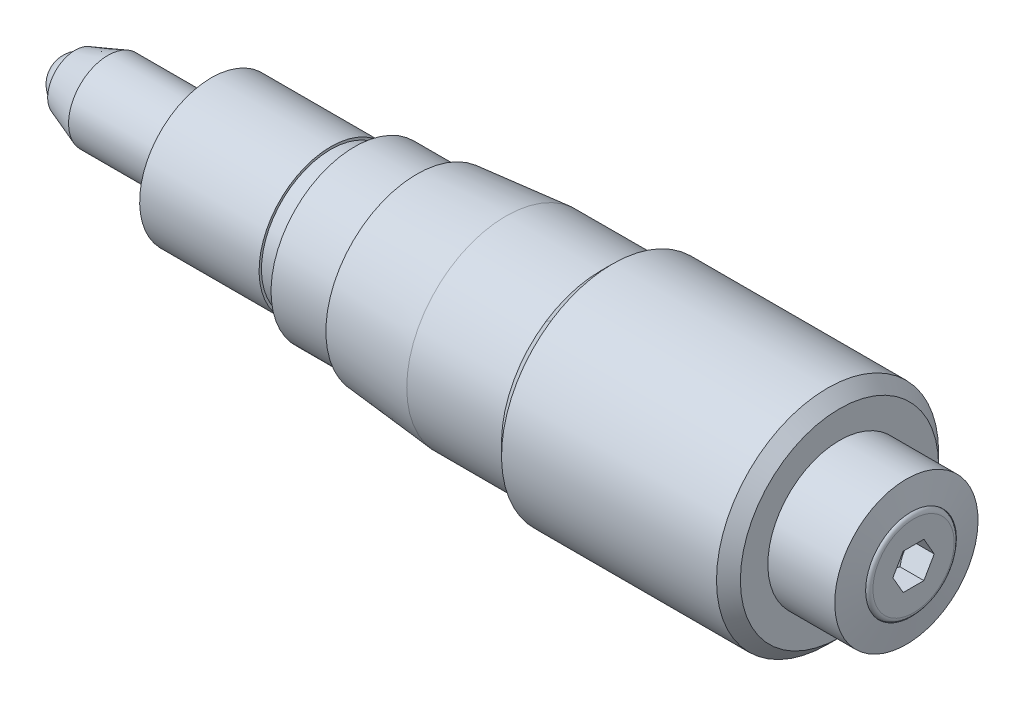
ISO-10303-21;
HEADER;
FILE_DESCRIPTION(('STEP AP214'),'2;1');
FILE_NAME('part.step','',(''),(''),'','','');
FILE_SCHEMA(('AUTOMOTIVE_DESIGN { 1 0 10303 214 1 1 1 1 }'));
ENDSEC;
DATA;
#1=APPLICATION_CONTEXT('core data for automotive mechanical design processes');
#2=APPLICATION_PROTOCOL_DEFINITION('international standard','automotive_design',2000,#1);
#3=PRODUCT_CONTEXT('',#1,'mechanical');
#4=PRODUCT('Part','Part','',(#3));
#5=PRODUCT_RELATED_PRODUCT_CATEGORY('part','',(#4));
#6=PRODUCT_DEFINITION_FORMATION('','',#4);
#7=PRODUCT_DEFINITION_CONTEXT('part definition',#1,'design');
#8=PRODUCT_DEFINITION('design','',#6,#7);
#9=PRODUCT_DEFINITION_SHAPE('','',#8);
#10=(LENGTH_UNIT() NAMED_UNIT(*) SI_UNIT(.MILLI.,.METRE.));
#11=(NAMED_UNIT(*) PLANE_ANGLE_UNIT() SI_UNIT($,.RADIAN.));
#12=(NAMED_UNIT(*) SI_UNIT($,.STERADIAN.) SOLID_ANGLE_UNIT());
#13=UNCERTAINTY_MEASURE_WITH_UNIT(LENGTH_MEASURE(1.E-05),#10,'distance_accuracy_value','');
#14=(GEOMETRIC_REPRESENTATION_CONTEXT(3) GLOBAL_UNCERTAINTY_ASSIGNED_CONTEXT((#13)) GLOBAL_UNIT_ASSIGNED_CONTEXT((#10,
#11,#12)) REPRESENTATION_CONTEXT('',''));
#15=CARTESIAN_POINT('',(0.,0.,0.));
#16=DIRECTION('',(0.,0.,1.));
#17=DIRECTION('',(1.,0.,0.));
#18=AXIS2_PLACEMENT_3D('',#15,#16,#17);
#19=CARTESIAN_POINT('',(-26.7640474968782,4.11650496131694,0.));
#20=DIRECTION('',(0.0761704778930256,0.771274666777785,0.631928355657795));
#21=DIRECTION('',(-0.837407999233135,-0.294540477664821,0.460427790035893));
#22=AXIS2_PLACEMENT_3D('',#19,#20,#21);
#23=SPHERICAL_SURFACE('',#22,1.);
#24=CARTESIAN_POINT('',(-26.9560983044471,4.11650496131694,0.981384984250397));
#25=CARTESIAN_POINT('',(-26.9560983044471,4.0613729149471,0.981381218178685));
#26=CARTESIAN_POINT('',(-26.9560983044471,4.00618339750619,0.976717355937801));
#27=CARTESIAN_POINT('',(-26.9560983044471,3.92462772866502,0.962842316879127));
#28=CARTESIAN_POINT('',(-26.9560983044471,3.8976255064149,0.957063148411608));
#29=CARTESIAN_POINT('',(-26.9560983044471,3.84417731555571,0.943247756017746));
#30=CARTESIAN_POINT('',(-26.9560983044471,3.81773185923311,0.935209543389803));
#31=CARTESIAN_POINT('',(-26.9560983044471,3.73962063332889,0.907805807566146));
#32=CARTESIAN_POINT('',(-26.9560983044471,3.68907297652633,0.88513286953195));
#33=CARTESIAN_POINT('',(-26.9560983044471,3.5925268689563,0.831632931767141));
#34=CARTESIAN_POINT('',(-26.9560983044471,3.54652850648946,0.800805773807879));
#35=CARTESIAN_POINT('',(-26.9560983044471,3.46035438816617,0.7318645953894));
#36=CARTESIAN_POINT('',(-26.9560983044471,3.42017846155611,0.693750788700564));
#37=CARTESIAN_POINT('',(-26.9560983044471,3.34679590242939,0.611318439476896));
#38=CARTESIAN_POINT('',(-26.9560983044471,3.31358954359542,0.566999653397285));
#39=CARTESIAN_POINT('',(-26.9560983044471,3.25508883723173,0.473416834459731));
#40=CARTESIAN_POINT('',(-26.9560983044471,3.22979434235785,0.424152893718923));
#41=CARTESIAN_POINT('',(-26.9560983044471,3.18783526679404,0.322077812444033));
#42=CARTESIAN_POINT('',(-26.9560983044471,3.17117066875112,0.269266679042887));
#43=CARTESIAN_POINT('',(-26.9560983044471,3.14694416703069,0.161596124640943));
#44=CARTESIAN_POINT('',(-26.9560983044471,3.13938228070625,0.106736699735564));
#45=CARTESIAN_POINT('',(-26.9560983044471,3.13357597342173,-0.0034729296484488));
#46=CARTESIAN_POINT('',(-26.9560983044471,3.13533153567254,-0.0588231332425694));
#47=CARTESIAN_POINT('',(-26.9560983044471,3.14811024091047,-0.168443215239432));
#48=CARTESIAN_POINT('',(-26.9560983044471,3.15913338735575,-0.222713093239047));
#49=CARTESIAN_POINT('',(-26.9560983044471,3.19013437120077,-0.328631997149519));
#50=CARTESIAN_POINT('',(-26.9560983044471,3.21011221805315,-0.38028102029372));
#51=CARTESIAN_POINT('',(-26.9560983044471,3.25845548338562,-0.479491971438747));
#52=CARTESIAN_POINT('',(-26.9560983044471,3.28682089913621,-0.527053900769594));
#53=CARTESIAN_POINT('',(-26.9560983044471,3.35113408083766,-0.616740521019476));
#54=CARTESIAN_POINT('',(-26.9560983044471,3.38708184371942,-0.658865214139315));
#55=CARTESIAN_POINT('',(-26.9560983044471,3.46553928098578,-0.736481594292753));
#56=CARTESIAN_POINT('',(-26.9560983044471,3.50804895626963,-0.771973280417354));
#57=CARTESIAN_POINT('',(-26.9560983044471,3.59842349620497,-0.835316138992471));
#58=CARTESIAN_POINT('',(-26.9560983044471,3.6462883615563,-0.8631673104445));
#59=CARTESIAN_POINT('',(-26.9560983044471,3.74601453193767,-0.910438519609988));
#60=CARTESIAN_POINT('',(-26.9560983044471,3.79787583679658,-0.929858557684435));
#61=CARTESIAN_POINT('',(-26.9560983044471,3.90412269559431,-0.959716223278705));
#62=CARTESIAN_POINT('',(-26.9560983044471,3.9585082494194,-0.970153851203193));
#63=CARTESIAN_POINT('',(-26.9560983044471,4.06825976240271,-0.981750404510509));
#64=CARTESIAN_POINT('',(-26.9560983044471,4.12362572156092,-0.982909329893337));
#65=CARTESIAN_POINT('',(-26.9560983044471,4.23376637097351,-0.975915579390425));
#66=CARTESIAN_POINT('',(-26.9560983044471,4.28854106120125,-0.967762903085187));
#67=CARTESIAN_POINT('',(-26.9560983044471,4.39594428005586,-0.942377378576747));
#68=CARTESIAN_POINT('',(-26.9560983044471,4.44857280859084,-0.925144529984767));
#69=CARTESIAN_POINT('',(-26.9560983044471,4.55018972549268,-0.882087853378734));
#70=CARTESIAN_POINT('',(-26.9560983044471,4.59917811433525,-0.856264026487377));
#71=CARTESIAN_POINT('',(-26.9560983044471,4.69212411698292,-0.796758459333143));
#72=CARTESIAN_POINT('',(-26.9560983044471,4.73608173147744,-0.763076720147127));
#73=CARTESIAN_POINT('',(-26.9560983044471,4.81771838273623,-0.688811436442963));
#74=CARTESIAN_POINT('',(-26.9560983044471,4.85539741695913,-0.648227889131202));
#75=CARTESIAN_POINT('',(-26.9560983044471,4.9234072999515,-0.561311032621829));
#76=CARTESIAN_POINT('',(-26.9560983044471,4.95373814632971,-0.514977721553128));
#77=CARTESIAN_POINT('',(-26.9560983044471,5.00619060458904,-0.417876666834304));
#78=CARTESIAN_POINT('',(-26.9560983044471,5.02831222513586,-0.367108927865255));
#79=CARTESIAN_POINT('',(-26.9560983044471,5.06371830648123,-0.262580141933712));
#80=CARTESIAN_POINT('',(-26.9560983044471,5.07700277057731,-0.208819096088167));
#81=CARTESIAN_POINT('',(-26.9560983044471,5.09435744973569,-0.0998296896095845));
#82=CARTESIAN_POINT('',(-26.9560983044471,5.09842764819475,-0.0446013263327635));
#83=CARTESIAN_POINT('',(-26.9560983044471,5.09723825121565,0.0657547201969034));
#84=CARTESIAN_POINT('',(-26.9560983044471,5.09197867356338,0.12088240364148));
#85=CARTESIAN_POINT('',(-26.9560983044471,5.07227887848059,0.229472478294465));
#86=CARTESIAN_POINT('',(-26.9560983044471,5.05783864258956,0.28293486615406));
#87=CARTESIAN_POINT('',(-26.9560983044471,5.02018769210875,0.386677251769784));
#88=CARTESIAN_POINT('',(-26.9560983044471,4.99697681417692,0.436957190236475));
#89=CARTESIAN_POINT('',(-26.9560983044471,4.94244229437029,0.532905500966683));
#90=CARTESIAN_POINT('',(-26.9560983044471,4.91111897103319,0.578574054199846));
#91=CARTESIAN_POINT('',(-26.9560983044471,4.84125583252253,0.664002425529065));
#92=CARTESIAN_POINT('',(-26.9560983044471,4.80271580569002,0.703762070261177));
#93=CARTESIAN_POINT('',(-26.9560983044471,4.71948264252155,0.776257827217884));
#94=CARTESIAN_POINT('',(-26.9560983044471,4.67478962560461,0.808994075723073));
#95=CARTESIAN_POINT('',(-26.9560983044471,4.60413039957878,0.852117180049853));
#96=CARTESIAN_POINT('',(-26.9560983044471,4.57994883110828,0.865504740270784));
#97=CARTESIAN_POINT('',(-26.9560983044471,4.53056818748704,0.890185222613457));
#98=CARTESIAN_POINT('',(-26.9560983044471,4.50537002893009,0.901479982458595));
#99=CARTESIAN_POINT('',(-26.9560983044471,4.42851505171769,0.932092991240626));
#100=CARTESIAN_POINT('',(-26.9560983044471,4.37551895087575,0.948187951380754));
#101=CARTESIAN_POINT('',(-26.9560983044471,4.28791438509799,0.966916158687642));
#102=CARTESIAN_POINT('',(-26.9560983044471,4.25386526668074,0.972334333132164));
#103=CARTESIAN_POINT('',(-26.9560983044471,4.18538656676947,0.979569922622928));
#104=CARTESIAN_POINT('',(-26.9560983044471,4.15095698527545,0.981387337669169));
#105=CARTESIAN_POINT('',(-26.9560983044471,4.11650496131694,0.981384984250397));
#106=B_SPLINE_CURVE_WITH_KNOTS('',3,(#24,#25,#26,#27,#28,#29,#30,#31,#32,#33,#34,#35,#36,#37,
#38,#39,#40,#41,#42,#43,#44,#45,#46,#47,#48,#49,#50,#51,#52,#53,#54,#55,#56,#57,#58,#59,#60,#61,
#62,#63,#64,#65,#66,#67,#68,#69,#70,#71,#72,#73,#74,#75,#76,#77,#78,#79,#80,#81,#82,#83,#84,#85,
#86,#87,#88,#89,#90,#91,#92,#93,#94,#95,#96,#97,#98,#99,#100,#101,#102,#103,#104,#105),
.UNSPECIFIED.,.T.,.F.,(4,2,2,2,2,2,2,2,2,2,2,2,2,2,2,2,2,2,2,2,2,2,2,2,2,2,2,2,2,2,2,2,2,2,2,2,
2,2,2,2,4),(0.,0.165248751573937,0.248009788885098,0.330843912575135,0.496190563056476,
0.661540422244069,0.826885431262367,0.992236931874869,1.15758535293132,1.3229334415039,
1.48828184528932,1.65362995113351,1.8189781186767,1.98432646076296,2.14967474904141,
2.31502297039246,2.48037121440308,2.64571948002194,2.81106773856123,2.97641598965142,
3.14176424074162,3.30711249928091,3.47246076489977,3.63780900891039,3.80315723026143,
3.96850551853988,4.13385386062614,4.29920202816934,4.46455013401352,4.62989853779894,
4.79524662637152,4.96059504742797,5.12594654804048,5.29129155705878,5.45664141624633,
5.62198806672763,5.70482219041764,5.78758322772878,5.95283197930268,6.05609594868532,
6.15935991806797),.UNSPECIFIED.);
#107=CARTESIAN_POINT('',(-26.9560983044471,4.11650496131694,0.981384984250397));
#108=VERTEX_POINT('',#107);
#109=EDGE_CURVE('E510',#108,#108,#106,.T.);
#110=ORIENTED_EDGE('',*,*,#109,.F.);
#111=EDGE_LOOP('',(#110));
#112=FACE_BOUND('',#111,.T.);
#113=ADVANCED_FACE('F17',(#112),#23,.T.);
#114=CARTESIAN_POINT('',(-26.9560983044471,4.17084989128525,0.572426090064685));
#115=DIRECTION('',(-1.,0.,0.));
#116=DIRECTION('',(0.,-1.,0.));
#117=AXIS2_PLACEMENT_3D('',#114,#115,#116);
#118=PLANE('',#117);
#119=ORIENTED_EDGE('',*,*,#109,.T.);
#120=EDGE_LOOP('',(#119));
#121=FACE_BOUND('',#120,.T.);
#122=CARTESIAN_POINT('',(-26.9560983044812,4.11650496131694,0.));
#123=DIRECTION('',(1.,0.,0.));
#124=DIRECTION('',(0.,0.,-1.));
#125=AXIS2_PLACEMENT_3D('',#122,#123,#124);
#126=CIRCLE('',#125,1.14999999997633);
#127=CARTESIAN_POINT('',(-26.9560983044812,4.11650496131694,-1.14999999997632));
#128=VERTEX_POINT('',#127);
#129=EDGE_CURVE('E215',#128,#128,#126,.T.);
#130=ORIENTED_EDGE('',*,*,#129,.F.);
#131=EDGE_LOOP('',(#130));
#132=FACE_BOUND('',#131,.T.);
#133=ADVANCED_FACE('F475',(#121,#132),#118,.T.);
#134=CARTESIAN_POINT('',(-25.5823595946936,4.11650496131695,0.));
#135=DIRECTION('',(1.,0.,0.));
#136=DIRECTION('',(0.,0.,-1.));
#137=AXIS2_PLACEMENT_3D('',#134,#135,#136);
#138=CONICAL_SURFACE('',#137,1.65000000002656,0.349065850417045);
#139=CARTESIAN_POINT('',(-25.5823595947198,4.11650496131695,0.));
#140=DIRECTION('',(1.,0.,0.));
#141=DIRECTION('',(0.,1.,0.));
#142=AXIS2_PLACEMENT_3D('',#139,#140,#141);
#143=CIRCLE('',#142,1.65);
#144=CARTESIAN_POINT('',(-25.5823595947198,5.76650496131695,0.));
#145=VERTEX_POINT('',#144);
#146=EDGE_CURVE('E211',#145,#145,#143,.T.);
#147=ORIENTED_EDGE('',*,*,#146,.F.);
#148=EDGE_LOOP('',(#147));
#149=FACE_BOUND('',#148,.T.);
#150=ORIENTED_EDGE('',*,*,#129,.T.);
#151=EDGE_LOOP('',(#150));
#152=FACE_BOUND('',#151,.T.);
#153=ADVANCED_FACE('F484',(#149,#152),#138,.T.);
#154=CARTESIAN_POINT('',(-20.1192289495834,4.11650496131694,0.));
#155=DIRECTION('',(1.,0.,0.));
#156=DIRECTION('',(0.,1.,0.));
#157=AXIS2_PLACEMENT_3D('',#154,#155,#156);
#158=CYLINDRICAL_SURFACE('',#157,1.65);
#159=CARTESIAN_POINT('',(-21.2560983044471,4.11650496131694,0.));
#160=DIRECTION('',(1.,0.,0.));
#161=DIRECTION('',(0.,1.,0.));
#162=AXIS2_PLACEMENT_3D('',#159,#160,#161);
#163=CIRCLE('',#162,1.65);
#164=CARTESIAN_POINT('',(-21.2560983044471,5.76650496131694,0.));
#165=VERTEX_POINT('',#164);
#166=EDGE_CURVE('E214',#165,#165,#163,.T.);
#167=ORIENTED_EDGE('',*,*,#166,.F.);
#168=EDGE_LOOP('',(#167));
#169=FACE_BOUND('',#168,.T.);
#170=ORIENTED_EDGE('',*,*,#146,.T.);
#171=EDGE_LOOP('',(#170));
#172=FACE_BOUND('',#171,.T.);
#173=ADVANCED_FACE('F480',(#169,#172),#158,.T.);
#174=CARTESIAN_POINT('',(-21.2560983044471,6.32548728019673,-0.725273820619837));
#175=DIRECTION('',(-1.,0.,0.));
#176=DIRECTION('',(0.,-1.,0.));
#177=AXIS2_PLACEMENT_3D('',#174,#175,#176);
#178=PLANE('',#177);
#179=ORIENTED_EDGE('',*,*,#166,.T.);
#180=EDGE_LOOP('',(#179));
#181=FACE_BOUND('',#180,.T.);
#182=CARTESIAN_POINT('',(-21.2560983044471,4.11650496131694,0.));
#183=DIRECTION('',(1.,0.,0.));
#184=DIRECTION('',(0.,1.,0.));
#185=AXIS2_PLACEMENT_3D('',#182,#183,#184);
#186=CIRCLE('',#185,3.);
#187=CARTESIAN_POINT('',(-21.2560983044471,7.11650496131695,0.));
#188=VERTEX_POINT('',#187);
#189=EDGE_CURVE('E93',#188,#188,#186,.T.);
#190=ORIENTED_EDGE('',*,*,#189,.F.);
#191=EDGE_LOOP('',(#190));
#192=FACE_BOUND('',#191,.T.);
#193=ADVANCED_FACE('F298',(#181,#192),#178,.T.);
#194=CARTESIAN_POINT('',(6.64390169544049,4.11650496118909,0.));
#195=DIRECTION('',(1.,0.,0.));
#196=DIRECTION('',(0.,0.,-1.));
#197=AXIS2_PLACEMENT_3D('',#194,#195,#196);
#198=CONICAL_SURFACE('',#197,0.,1.04719755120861);
#199=CARTESIAN_POINT('',(6.64390169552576,4.11650496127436,0.));
#200=VERTEX_POINT('',#199);
#201=VERTEX_LOOP('',#200);
#202=FACE_BOUND('',#201,.T.);
#203=CARTESIAN_POINT('',(7.14390169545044,4.11650496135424,0.866025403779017));
#204=CARTESIAN_POINT('',(7.13291252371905,4.08354700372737,0.846997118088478));
#205=CARTESIAN_POINT('',(7.12291844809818,4.05030455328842,0.827804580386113));
#206=CARTESIAN_POINT('',(7.10547408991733,3.98324408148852,0.789087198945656));
#207=CARTESIAN_POINT('',(7.09802997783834,3.94942486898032,0.769561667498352));
#208=CARTESIAN_POINT('',(7.08644268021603,3.88220554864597,0.730752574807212));
#209=CARTESIAN_POINT('',(7.08222236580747,3.84881578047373,0.711474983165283));
#210=CARTESIAN_POINT('',(7.07718513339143,3.78187921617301,0.67282913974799));
#211=CARTESIAN_POINT('',(7.0763640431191,3.74833266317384,0.6534610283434));
#212=CARTESIAN_POINT('',(7.07807655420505,3.68565452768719,0.617273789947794));
#213=CARTESIAN_POINT('',(7.0801896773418,3.6565135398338,0.600449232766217));
#214=CARTESIAN_POINT('',(7.08688568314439,3.59842140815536,0.566909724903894));
#215=CARTESIAN_POINT('',(7.09147085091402,3.56947046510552,0.550194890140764));
#216=CARTESIAN_POINT('',(7.10293288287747,3.51125865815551,0.516586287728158));
#217=CARTESIAN_POINT('',(7.10985831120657,3.48200515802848,0.499696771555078));
#218=CARTESIAN_POINT('',(7.12557610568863,3.42393434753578,0.466169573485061));
#219=CARTESIAN_POINT('',(7.134364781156,3.3951162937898,0.449531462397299));
#220=CARTESIAN_POINT('',(7.14390169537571,3.36650496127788,0.433012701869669));
#221=B_SPLINE_CURVE_WITH_KNOTS('',3,(#203,#204,#205,#206,#207,#208,#209,#210,#211,#212,#213,
#214,#215,#216,#217,#218,#219,#220),.UNSPECIFIED.,.F.,.F.,(4,2,2,2,2,2,2,2,4),(0.,
0.1188810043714,0.238047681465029,0.354265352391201,0.470340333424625,0.571390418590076,
0.67253407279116,0.775920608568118,0.879104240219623),.UNSPECIFIED.);
#222=CARTESIAN_POINT('',(7.14390169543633,4.11650496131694,0.86602540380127));
#223=VERTEX_POINT('',#222);
#224=CARTESIAN_POINT('',(7.14390169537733,3.36650496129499,0.433012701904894));
#225=VERTEX_POINT('',#224);
#226=EDGE_CURVE('E126',#223,#225,#221,.T.);
#227=ORIENTED_EDGE('',*,*,#226,.T.);
#228=CARTESIAN_POINT('',(7.14390169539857,3.3665049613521,0.433012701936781));
#229=CARTESIAN_POINT('',(7.13363936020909,3.36650496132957,0.397466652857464));
#230=CARTESIAN_POINT('',(7.12424390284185,3.36650496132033,0.361639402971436));
#231=CARTESIAN_POINT('',(7.10763859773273,3.36650496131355,0.289402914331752));
#232=CARTESIAN_POINT('',(7.10043364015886,3.36650496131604,0.252992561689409));
#233=CARTESIAN_POINT('',(7.08884719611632,3.36650496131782,0.180580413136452));
#234=CARTESIAN_POINT('',(7.08440393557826,3.36650496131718,0.144588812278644));
#235=CARTESIAN_POINT('',(7.07843912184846,3.36650496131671,0.0723979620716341));
#236=CARTESIAN_POINT('',(7.07691439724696,3.36650496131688,0.0361989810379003));
#237=CARTESIAN_POINT('',(7.0769143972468,3.36650496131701,-0.0361989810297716));
#238=CARTESIAN_POINT('',(7.07843912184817,3.36650496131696,-0.0723979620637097));
#239=CARTESIAN_POINT('',(7.08440393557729,3.36650496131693,-0.144588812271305));
#240=CARTESIAN_POINT('',(7.08884719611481,3.36650496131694,-0.180580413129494));
#241=CARTESIAN_POINT('',(7.10043364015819,3.36650496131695,-0.252992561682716));
#242=CARTESIAN_POINT('',(7.10763859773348,3.36650496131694,-0.289402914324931));
#243=CARTESIAN_POINT('',(7.12424390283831,3.36650496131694,-0.361639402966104));
#244=CARTESIAN_POINT('',(7.13363936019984,3.36650496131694,-0.397466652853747));
#245=CARTESIAN_POINT('',(7.14390169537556,3.36650496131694,-0.433012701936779));
#246=B_SPLINE_CURVE_WITH_KNOTS('',3,(#228,#229,#230,#231,#232,#233,#234,#235,#236,#237,#238,
#239,#240,#241,#242,#243,#244,#245),.UNSPECIFIED.,.F.,.F.,(4,2,2,2,2,2,2,2,4),(0.,
0.111027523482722,0.222301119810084,0.330986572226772,0.439553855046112,0.548121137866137,
0.656806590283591,0.768080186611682,0.87910771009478),.UNSPECIFIED.);
#247=CARTESIAN_POINT('',(7.14390169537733,3.36650496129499,-0.433012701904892));
#248=VERTEX_POINT('',#247);
#249=EDGE_CURVE('E121',#225,#248,#246,.T.);
#250=ORIENTED_EDGE('',*,*,#249,.T.);
#251=CARTESIAN_POINT('',(7.14390169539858,3.36650496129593,-0.433012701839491));
#252=CARTESIAN_POINT('',(7.1329125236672,3.39946291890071,-0.45204098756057));
#253=CARTESIAN_POINT('',(7.1229184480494,3.43270536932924,-0.471233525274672));
#254=CARTESIAN_POINT('',(7.10547408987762,3.49976584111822,-0.509950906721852));
#255=CARTESIAN_POINT('',(7.09802997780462,3.53358505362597,-0.5294764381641));
#256=CARTESIAN_POINT('',(7.08644268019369,3.60080437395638,-0.568285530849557));
#257=CARTESIAN_POINT('',(7.08222236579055,3.63419414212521,-0.587563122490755));
#258=CARTESIAN_POINT('',(7.07718513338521,3.70113070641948,-0.626208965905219));
#259=CARTESIAN_POINT('',(7.07636404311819,3.73467725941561,-0.645577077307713));
#260=CARTESIAN_POINT('',(7.07807655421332,3.79735539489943,-0.681764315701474));
#261=CARTESIAN_POINT('',(7.08018967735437,3.8264963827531,-0.698588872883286));
#262=CARTESIAN_POINT('',(7.08688568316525,3.88458851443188,-0.732128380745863));
#263=CARTESIAN_POINT('',(7.09147085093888,3.91353945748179,-0.748843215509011));
#264=CARTESIAN_POINT('',(7.10293288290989,3.97175126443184,-0.782451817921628));
#265=CARTESIAN_POINT('',(7.10985831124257,4.00100476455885,-0.799341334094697));
#266=CARTESIAN_POINT('',(7.12557610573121,4.05907557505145,-0.832868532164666));
#267=CARTESIAN_POINT('',(7.1343647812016,4.08789362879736,-0.84950664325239));
#268=CARTESIAN_POINT('',(7.14390169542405,4.11650496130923,-0.866025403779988));
#269=B_SPLINE_CURVE_WITH_KNOTS('',3,(#251,#252,#253,#254,#255,#256,#257,#258,#259,#260,#261,
#262,#263,#264,#265,#266,#267,#268),.UNSPECIFIED.,.F.,.F.,(4,2,2,2,2,2,2,2,4),(0.,
0.118881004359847,0.238047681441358,0.354265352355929,0.470340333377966,0.571390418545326,
0.672534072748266,0.775920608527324,0.879104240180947),.UNSPECIFIED.);
#270=CARTESIAN_POINT('',(7.14390169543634,4.11650496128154,-0.866025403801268));
#271=VERTEX_POINT('',#270);
#272=EDGE_CURVE('E100',#248,#271,#269,.T.);
#273=ORIENTED_EDGE('',*,*,#272,.T.);
#274=CARTESIAN_POINT('',(7.14390169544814,4.11650496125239,-0.866025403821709));
#275=CARTESIAN_POINT('',(7.13291252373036,4.14946291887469,-0.846997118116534));
#276=CARTESIAN_POINT('',(7.1229184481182,4.18270536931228,-0.827804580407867));
#277=CARTESIAN_POINT('',(7.10547408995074,4.24976584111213,-0.789087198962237));
#278=CARTESIAN_POINT('',(7.09802997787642,4.28358505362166,-0.769561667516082));
#279=CARTESIAN_POINT('',(7.08644268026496,4.35080437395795,-0.730752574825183));
#280=CARTESIAN_POINT('',(7.08222236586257,4.38419414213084,-0.711474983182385));
#281=CARTESIAN_POINT('',(7.07718513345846,4.45113070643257,-0.672829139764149));
#282=CARTESIAN_POINT('',(7.0763640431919,4.48467725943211,-0.653461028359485));
#283=CARTESIAN_POINT('',(7.07807655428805,4.54735539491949,-0.617273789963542));
#284=CARTESIAN_POINT('',(7.08018967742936,4.5764963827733,-0.600449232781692));
#285=CARTESIAN_POINT('',(7.08688568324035,4.63458851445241,-0.56690972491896));
#286=CARTESIAN_POINT('',(7.09147085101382,4.6635394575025,-0.550194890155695));
#287=CARTESIAN_POINT('',(7.10293288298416,4.72175126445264,-0.516586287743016));
#288=CARTESIAN_POINT('',(7.10985831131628,4.75100476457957,-0.499696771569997));
#289=CARTESIAN_POINT('',(7.12557610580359,4.80907557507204,-0.466169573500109));
#290=CARTESIAN_POINT('',(7.1343647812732,4.8378936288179,-0.449531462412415));
#291=CARTESIAN_POINT('',(7.14390169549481,4.86650496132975,-0.433012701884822));
#292=B_SPLINE_CURVE_WITH_KNOTS('',3,(#274,#275,#276,#277,#278,#279,#280,#281,#282,#283,#284,
#285,#286,#287,#288,#289,#290,#291),.UNSPECIFIED.,.F.,.F.,(4,2,2,2,2,2,2,2,4),(0.,
0.118881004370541,0.238047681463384,0.354265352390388,0.470340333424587,0.571390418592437,
0.672534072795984,0.775920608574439,0.879104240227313),.UNSPECIFIED.);
#293=CARTESIAN_POINT('',(7.14390169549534,4.86650496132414,-0.433012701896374));
#294=VERTEX_POINT('',#293);
#295=EDGE_CURVE('E96',#271,#294,#292,.T.);
#296=ORIENTED_EDGE('',*,*,#295,.T.);
#297=CARTESIAN_POINT('',(7.14390169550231,4.86650496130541,-0.433012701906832));
#298=CARTESIAN_POINT('',(7.1336393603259,4.8665049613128,-0.397466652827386));
#299=CARTESIAN_POINT('',(7.12424390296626,4.86650496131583,-0.36163940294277));
#300=CARTESIAN_POINT('',(7.10763859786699,4.86650496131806,-0.289402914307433));
#301=CARTESIAN_POINT('',(7.10043364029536,4.86650496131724,-0.252992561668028));
#302=CARTESIAN_POINT('',(7.08884719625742,4.86650496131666,-0.180580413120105));
#303=CARTESIAN_POINT('',(7.08440393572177,4.86650496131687,-0.144588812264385));
#304=CARTESIAN_POINT('',(7.07843912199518,4.86650496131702,-0.0723979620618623));
#305=CARTESIAN_POINT('',(7.07691439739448,4.86650496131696,-0.0361989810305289));
#306=CARTESIAN_POINT('',(7.07691439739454,4.86650496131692,0.0361989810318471));
#307=CARTESIAN_POINT('',(7.0784391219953,4.86650496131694,0.0723979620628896));
#308=CARTESIAN_POINT('',(7.08440393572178,4.86650496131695,0.144588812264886));
#309=CARTESIAN_POINT('',(7.08884719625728,4.86650496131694,0.180580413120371));
#310=CARTESIAN_POINT('',(7.10043364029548,4.86650496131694,0.252992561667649));
#311=CARTESIAN_POINT('',(7.10763859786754,4.86650496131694,0.289402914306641));
#312=CARTESIAN_POINT('',(7.12424390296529,4.86650496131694,0.361639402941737));
#313=CARTESIAN_POINT('',(7.13363936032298,4.86650496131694,0.397466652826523));
#314=CARTESIAN_POINT('',(7.14390169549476,4.86650496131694,0.433012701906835));
#315=B_SPLINE_CURVE_WITH_KNOTS('',3,(#297,#298,#299,#300,#301,#302,#303,#304,#305,#306,#307,
#308,#309,#310,#311,#312,#313,#314),.UNSPECIFIED.,.F.,.F.,(4,2,2,2,2,2,2,2,4),(0.,
0.111027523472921,0.222301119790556,0.330986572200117,0.439553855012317,0.548121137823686,
0.656806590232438,0.768080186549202,0.879107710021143),.UNSPECIFIED.);
#316=CARTESIAN_POINT('',(7.14390169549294,4.86650496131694,0.433012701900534));
#317=VERTEX_POINT('',#316);
#318=EDGE_CURVE('E82',#294,#317,#315,.T.);
#319=ORIENTED_EDGE('',*,*,#318,.T.);
#320=CARTESIAN_POINT('',(7.14390169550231,4.86650496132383,0.433012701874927));
#321=CARTESIAN_POINT('',(7.132912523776,4.83354700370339,0.452040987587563));
#322=CARTESIAN_POINT('',(7.12291844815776,4.80030455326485,0.471233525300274));
#323=CARTESIAN_POINT('',(7.10547408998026,4.7332440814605,0.509950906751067));
#324=CARTESIAN_POINT('',(7.09802997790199,4.69942486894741,0.529476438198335));
#325=CARTESIAN_POINT('',(7.08644268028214,4.63220554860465,0.568285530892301));
#326=CARTESIAN_POINT('',(7.08222236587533,4.59881578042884,0.587563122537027));
#327=CARTESIAN_POINT('',(7.07718513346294,4.53187921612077,0.626208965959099));
#328=CARTESIAN_POINT('',(7.07636404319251,4.49833266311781,0.645577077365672));
#329=CARTESIAN_POINT('',(7.07807655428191,4.4356545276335,0.681764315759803));
#330=CARTESIAN_POINT('',(7.08018967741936,4.40651353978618,0.69858887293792));
#331=CARTESIAN_POINT('',(7.08688568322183,4.34842140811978,0.732128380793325));
#332=CARTESIAN_POINT('',(7.09147085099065,4.3194704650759,0.748843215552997));
#333=CARTESIAN_POINT('',(7.10293288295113,4.26125865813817,0.78245181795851));
#334=CARTESIAN_POINT('',(7.10985831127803,4.23200515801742,0.79934133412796));
#335=CARTESIAN_POINT('',(7.12557610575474,4.17393434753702,0.832868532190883));
#336=CARTESIAN_POINT('',(7.13436478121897,4.14511629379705,0.84950664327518));
#337=CARTESIAN_POINT('',(7.14390169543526,4.11650496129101,0.866025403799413));
#338=B_SPLINE_CURVE_WITH_KNOTS('',3,(#320,#321,#322,#323,#324,#325,#326,#327,#328,#329,#330,
#331,#332,#333,#334,#335,#336,#337),.UNSPECIFIED.,.F.,.F.,(4,2,2,2,2,2,2,2,4),(0.,
0.11888100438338,0.238047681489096,0.354265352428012,0.470340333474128,0.571390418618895,
0.672534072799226,0.77592060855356,0.879104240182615),.UNSPECIFIED.);
#339=EDGE_CURVE('E130',#317,#223,#338,.T.);
#340=ORIENTED_EDGE('',*,*,#339,.T.);
#341=EDGE_LOOP('',(#227,#250,#273,#296,#319,#340));
#342=FACE_BOUND('',#341,.T.);
#343=ADVANCED_FACE('F98',(#202,#342),#198,.F.);
#344=CARTESIAN_POINT('',(-18.7560983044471,4.11650496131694,0.));
#345=DIRECTION('',(1.,0.,0.));
#346=DIRECTION('',(0.,1.,0.));
#347=AXIS2_PLACEMENT_3D('',#344,#345,#346);
#348=CYLINDRICAL_SURFACE('',#347,3.);
#349=CARTESIAN_POINT('',(-16.2560983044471,4.11650496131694,0.));
#350=DIRECTION('',(1.,0.,0.));
#351=DIRECTION('',(0.,1.,0.));
#352=AXIS2_PLACEMENT_3D('',#349,#350,#351);
#353=CIRCLE('',#352,3.);
#354=CARTESIAN_POINT('',(-16.2560983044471,7.11650496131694,0.));
#355=VERTEX_POINT('',#354);
#356=EDGE_CURVE('E184',#355,#355,#353,.T.);
#357=ORIENTED_EDGE('',*,*,#356,.F.);
#358=EDGE_LOOP('',(#357));
#359=FACE_BOUND('',#358,.T.);
#360=ORIENTED_EDGE('',*,*,#189,.T.);
#361=EDGE_LOOP('',(#360));
#362=FACE_BOUND('',#361,.T.);
#363=ADVANCED_FACE('F292',(#359,#362),#348,.T.);
#364=CARTESIAN_POINT('',(8.14390169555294,4.86650496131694,-0.433012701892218));
#365=DIRECTION('',(0.,1.,0.));
#366=DIRECTION('',(0.,0.,1.));
#367=AXIS2_PLACEMENT_3D('',#364,#365,#366);
#368=PLANE('',#367);
#369=DIRECTION('',(1.,0.,0.));
#370=VECTOR('',#369,1.);
#371=CARTESIAN_POINT('',(8.14390169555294,4.86650496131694,-0.433012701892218));
#372=LINE('',#371,#370);
#373=CARTESIAN_POINT('',(8.14390169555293,4.86650496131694,-0.433012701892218));
#374=VERTEX_POINT('',#373);
#375=EDGE_CURVE('E86',#294,#374,#372,.T.);
#376=ORIENTED_EDGE('',*,*,#375,.T.);
#377=DIRECTION('',(0.,0.,-1.));
#378=VECTOR('',#377,1.);
#379=CARTESIAN_POINT('',(8.14390169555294,4.86650496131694,0.));
#380=LINE('',#379,#378);
#381=CARTESIAN_POINT('',(8.14390169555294,4.86650496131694,0.433012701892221));
#382=VERTEX_POINT('',#381);
#383=EDGE_CURVE('E177',#382,#374,#380,.T.);
#384=ORIENTED_EDGE('',*,*,#383,.F.);
#385=DIRECTION('',(1.,0.,0.));
#386=VECTOR('',#385,1.);
#387=CARTESIAN_POINT('',(8.14390169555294,4.86650496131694,0.433012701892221));
#388=LINE('',#387,#386);
#389=EDGE_CURVE('E89',#382,#317,#388,.F.);
#390=ORIENTED_EDGE('',*,*,#389,.T.);
#391=ORIENTED_EDGE('',*,*,#318,.F.);
#392=EDGE_LOOP('',(#376,#384,#390,#391));
#393=FACE_BOUND('',#392,.T.);
#394=ADVANCED_FACE('F84',(#393),#368,.F.);
#395=CARTESIAN_POINT('',(8.14390169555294,4.11650496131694,-0.866025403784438));
#396=DIRECTION('',(0.,0.5,-0.866025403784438));
#397=DIRECTION('',(0.,0.866025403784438,0.5));
#398=AXIS2_PLACEMENT_3D('',#395,#396,#397);
#399=PLANE('',#398);
#400=DIRECTION('',(1.,0.,0.));
#401=VECTOR('',#400,1.);
#402=CARTESIAN_POINT('',(8.14390169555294,4.11650496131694,-0.866025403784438));
#403=LINE('',#402,#401);
#404=CARTESIAN_POINT('',(8.14390169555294,4.11650496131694,-0.866025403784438));
#405=VERTEX_POINT('',#404);
#406=EDGE_CURVE('E103',#271,#405,#403,.T.);
#407=ORIENTED_EDGE('',*,*,#406,.T.);
#408=DIRECTION('',(0.,-0.866025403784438,-0.5));
#409=VECTOR('',#408,1.);
#410=CARTESIAN_POINT('',(8.14390169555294,4.86650496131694,-0.433012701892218));
#411=LINE('',#410,#409);
#412=EDGE_CURVE('E107',#374,#405,#411,.T.);
#413=ORIENTED_EDGE('',*,*,#412,.F.);
#414=ORIENTED_EDGE('',*,*,#375,.F.);
#415=ORIENTED_EDGE('',*,*,#295,.F.);
#416=EDGE_LOOP('',(#407,#413,#414,#415));
#417=FACE_BOUND('',#416,.T.);
#418=ADVANCED_FACE('F105',(#417),#399,.F.);
#419=CARTESIAN_POINT('',(8.14390169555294,3.36650496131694,-0.433012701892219));
#420=DIRECTION('',(0.,-0.5,-0.866025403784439));
#421=DIRECTION('',(0.,0.866025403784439,-0.5));
#422=AXIS2_PLACEMENT_3D('',#419,#420,#421);
#423=PLANE('',#422);
#424=DIRECTION('',(1.,0.,0.));
#425=VECTOR('',#424,1.);
#426=CARTESIAN_POINT('',(8.14390169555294,3.36650496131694,-0.433012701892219));
#427=LINE('',#426,#425);
#428=CARTESIAN_POINT('',(8.14390169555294,3.36650496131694,-0.433012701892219));
#429=VERTEX_POINT('',#428);
#430=EDGE_CURVE('E119',#248,#429,#427,.T.);
#431=ORIENTED_EDGE('',*,*,#430,.T.);
#432=DIRECTION('',(0.,-0.866025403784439,0.5));
#433=VECTOR('',#432,1.);
#434=CARTESIAN_POINT('',(8.14390169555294,4.11650496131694,-0.866025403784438));
#435=LINE('',#434,#433);
#436=EDGE_CURVE('E201',#405,#429,#435,.T.);
#437=ORIENTED_EDGE('',*,*,#436,.F.);
#438=ORIENTED_EDGE('',*,*,#406,.F.);
#439=ORIENTED_EDGE('',*,*,#272,.F.);
#440=EDGE_LOOP('',(#431,#437,#438,#439));
#441=FACE_BOUND('',#440,.T.);
#442=ADVANCED_FACE('F269',(#441),#423,.F.);
#443=CARTESIAN_POINT('',(8.14390169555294,3.36650496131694,0.43301270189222));
#444=DIRECTION('',(0.,-1.,0.));
#445=DIRECTION('',(1.,0.,0.));
#446=AXIS2_PLACEMENT_3D('',#443,#444,#445);
#447=PLANE('',#446);
#448=DIRECTION('',(1.,0.,0.));
#449=VECTOR('',#448,1.);
#450=CARTESIAN_POINT('',(8.14390169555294,3.36650496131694,0.43301270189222));
#451=LINE('',#450,#449);
#452=CARTESIAN_POINT('',(8.14390169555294,3.36650496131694,0.43301270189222));
#453=VERTEX_POINT('',#452);
#454=EDGE_CURVE('E124',#225,#453,#451,.T.);
#455=ORIENTED_EDGE('',*,*,#454,.T.);
#456=DIRECTION('',(0.,0.,-1.));
#457=VECTOR('',#456,1.);
#458=CARTESIAN_POINT('',(8.14390169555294,3.36650496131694,0.));
#459=LINE('',#458,#457);
#460=EDGE_CURVE('E196',#429,#453,#459,.F.);
#461=ORIENTED_EDGE('',*,*,#460,.F.);
#462=ORIENTED_EDGE('',*,*,#430,.F.);
#463=ORIENTED_EDGE('',*,*,#249,.F.);
#464=EDGE_LOOP('',(#455,#461,#462,#463));
#465=FACE_BOUND('',#464,.T.);
#466=ADVANCED_FACE('F264',(#465),#447,.F.);
#467=CARTESIAN_POINT('',(8.14390169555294,4.11650496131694,0.86602540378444));
#468=DIRECTION('',(0.,-0.5,0.866025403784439));
#469=DIRECTION('',(0.,-0.866025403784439,-0.5));
#470=AXIS2_PLACEMENT_3D('',#467,#468,#469);
#471=PLANE('',#470);
#472=DIRECTION('',(1.,0.,0.));
#473=VECTOR('',#472,1.);
#474=CARTESIAN_POINT('',(8.14390169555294,4.11650496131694,0.86602540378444));
#475=LINE('',#474,#473);
#476=CARTESIAN_POINT('',(8.14390169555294,4.11650496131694,0.86602540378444));
#477=VERTEX_POINT('',#476);
#478=EDGE_CURVE('E131',#223,#477,#475,.T.);
#479=ORIENTED_EDGE('',*,*,#478,.T.);
#480=DIRECTION('',(0.,0.866025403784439,0.5));
#481=VECTOR('',#480,1.);
#482=CARTESIAN_POINT('',(8.14390169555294,3.36650496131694,0.43301270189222));
#483=LINE('',#482,#481);
#484=EDGE_CURVE('E191',#453,#477,#483,.T.);
#485=ORIENTED_EDGE('',*,*,#484,.F.);
#486=ORIENTED_EDGE('',*,*,#454,.F.);
#487=ORIENTED_EDGE('',*,*,#226,.F.);
#488=EDGE_LOOP('',(#479,#485,#486,#487));
#489=FACE_BOUND('',#488,.T.);
#490=ADVANCED_FACE('F259',(#489),#471,.F.);
#491=CARTESIAN_POINT('',(8.14390169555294,4.86650496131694,0.433012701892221));
#492=DIRECTION('',(0.,0.5,0.866025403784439));
#493=DIRECTION('',(0.,-0.866025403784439,0.5));
#494=AXIS2_PLACEMENT_3D('',#491,#492,#493);
#495=PLANE('',#494);
#496=ORIENTED_EDGE('',*,*,#389,.F.);
#497=DIRECTION('',(0.,0.866025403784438,-0.5));
#498=VECTOR('',#497,1.);
#499=CARTESIAN_POINT('',(8.14390169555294,4.11650496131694,0.86602540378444));
#500=LINE('',#499,#498);
#501=EDGE_CURVE('E187',#477,#382,#500,.T.);
#502=ORIENTED_EDGE('',*,*,#501,.F.);
#503=ORIENTED_EDGE('',*,*,#478,.F.);
#504=ORIENTED_EDGE('',*,*,#339,.F.);
#505=EDGE_LOOP('',(#496,#502,#503,#504));
#506=FACE_BOUND('',#505,.T.);
#507=ADVANCED_FACE('F256',(#506),#495,.F.);
#508=CARTESIAN_POINT('',(-16.2560983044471,6.9192997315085,-0.920239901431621));
#509=DIRECTION('',(1.,0.,0.));
#510=DIRECTION('',(0.,1.,0.));
#511=AXIS2_PLACEMENT_3D('',#508,#509,#510);
#512=PLANE('',#511);
#513=ORIENTED_EDGE('',*,*,#356,.T.);
#514=EDGE_LOOP('',(#513));
#515=FACE_BOUND('',#514,.T.);
#516=CARTESIAN_POINT('',(-16.2560983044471,4.11650496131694,0.));
#517=DIRECTION('',(1.,0.,0.));
#518=DIRECTION('',(0.,1.,0.));
#519=AXIS2_PLACEMENT_3D('',#516,#517,#518);
#520=CIRCLE('',#519,2.9);
#521=CARTESIAN_POINT('',(-16.2560983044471,7.01650496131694,0.));
#522=VERTEX_POINT('',#521);
#523=EDGE_CURVE('E190',#522,#522,#520,.T.);
#524=ORIENTED_EDGE('',*,*,#523,.F.);
#525=EDGE_LOOP('',(#524));
#526=FACE_BOUND('',#525,.T.);
#527=ADVANCED_FACE('F159',(#515,#526),#512,.T.);
#528=CARTESIAN_POINT('',(8.14390169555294,5.49951766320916,0.));
#529=DIRECTION('',(1.,0.,0.));
#530=DIRECTION('',(0.,0.,-1.));
#531=AXIS2_PLACEMENT_3D('',#528,#529,#530);
#532=PLANE('',#531);
#533=CARTESIAN_POINT('',(8.14390169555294,4.11650496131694,0.));
#534=DIRECTION('',(-1.,0.,0.));
#535=DIRECTION('',(0.,1.,0.));
#536=AXIS2_PLACEMENT_3D('',#533,#534,#535);
#537=CIRCLE('',#536,1.7);
#538=CARTESIAN_POINT('',(8.14390169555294,5.81650496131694,0.));
#539=VERTEX_POINT('',#538);
#540=EDGE_CURVE('E141',#539,#539,#537,.T.);
#541=ORIENTED_EDGE('',*,*,#540,.F.);
#542=EDGE_LOOP('',(#541));
#543=FACE_BOUND('',#542,.T.);
#544=ORIENTED_EDGE('',*,*,#484,.T.);
#545=ORIENTED_EDGE('',*,*,#501,.T.);
#546=ORIENTED_EDGE('',*,*,#383,.T.);
#547=ORIENTED_EDGE('',*,*,#412,.T.);
#548=ORIENTED_EDGE('',*,*,#436,.T.);
#549=ORIENTED_EDGE('',*,*,#460,.T.);
#550=EDGE_LOOP('',(#544,#545,#546,#547,#548,#549));
#551=FACE_BOUND('',#550,.T.);
#552=ADVANCED_FACE('F148',(#543,#551),#532,.T.);
#553=CARTESIAN_POINT('',(-15.7560983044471,4.11650496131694,0.));
#554=DIRECTION('',(1.,0.,0.));
#555=DIRECTION('',(0.,1.,0.));
#556=AXIS2_PLACEMENT_3D('',#553,#554,#555);
#557=CYLINDRICAL_SURFACE('',#556,2.9);
#558=CARTESIAN_POINT('',(-15.2560983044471,4.11650496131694,0.));
#559=DIRECTION('',(1.,0.,0.));
#560=DIRECTION('',(0.,1.,0.));
#561=AXIS2_PLACEMENT_3D('',#558,#559,#560);
#562=CIRCLE('',#561,2.9);
#563=CARTESIAN_POINT('',(-15.2560983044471,7.01650496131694,0.));
#564=VERTEX_POINT('',#563);
#565=EDGE_CURVE('E236',#564,#564,#562,.T.);
#566=ORIENTED_EDGE('',*,*,#565,.F.);
#567=EDGE_LOOP('',(#566));
#568=FACE_BOUND('',#567,.T.);
#569=ORIENTED_EDGE('',*,*,#523,.T.);
#570=EDGE_LOOP('',(#569));
#571=FACE_BOUND('',#570,.T.);
#572=ADVANCED_FACE('F158',(#568,#571),#557,.T.);
#573=CARTESIAN_POINT('',(7.94390169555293,4.11650496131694,0.));
#574=DIRECTION('',(-1.,0.,0.));
#575=DIRECTION('',(0.,0.,1.));
#576=AXIS2_PLACEMENT_3D('',#573,#574,#575);
#577=TOROIDAL_SURFACE('',#576,1.7,0.2);
#578=CARTESIAN_POINT('',(7.94390169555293,4.11650496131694,0.));
#579=DIRECTION('',(1.,0.,0.));
#580=DIRECTION('',(0.,1.,0.));
#581=AXIS2_PLACEMENT_3D('',#578,#579,#580);
#582=CIRCLE('',#581,1.9);
#583=CARTESIAN_POINT('',(7.94390169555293,6.01650496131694,0.));
#584=VERTEX_POINT('',#583);
#585=EDGE_CURVE('E235',#584,#584,#582,.T.);
#586=ORIENTED_EDGE('',*,*,#585,.T.);
#587=EDGE_LOOP('',(#586));
#588=FACE_BOUND('',#587,.T.);
#589=ORIENTED_EDGE('',*,*,#540,.T.);
#590=EDGE_LOOP('',(#589));
#591=FACE_BOUND('',#590,.T.);
#592=ADVANCED_FACE('F163',(#588,#591),#577,.T.);
#593=CARTESIAN_POINT('',(-15.2560983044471,7.1568247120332,-0.998226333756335));
#594=DIRECTION('',(-1.,0.,0.));
#595=DIRECTION('',(0.,-1.,0.));
#596=AXIS2_PLACEMENT_3D('',#593,#594,#595);
#597=PLANE('',#596);
#598=ORIENTED_EDGE('',*,*,#565,.T.);
#599=EDGE_LOOP('',(#598));
#600=FACE_BOUND('',#599,.T.);
#601=CARTESIAN_POINT('',(-15.2560983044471,4.11650496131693,0.));
#602=DIRECTION('',(-1.,0.,0.));
#603=DIRECTION('',(0.,-1.,0.));
#604=AXIS2_PLACEMENT_3D('',#601,#602,#603);
#605=CIRCLE('',#604,3.5);
#606=CARTESIAN_POINT('',(-15.2560983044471,0.616504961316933,0.));
#607=VERTEX_POINT('',#606);
#608=EDGE_CURVE('E232',#607,#607,#605,.F.);
#609=ORIENTED_EDGE('',*,*,#608,.F.);
#610=EDGE_LOOP('',(#609));
#611=FACE_BOUND('',#610,.T.);
#612=ADVANCED_FACE('F168',(#600,#611),#597,.T.);
#613=CARTESIAN_POINT('',(7.09390169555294,4.11650496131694,0.));
#614=DIRECTION('',(1.,0.,0.));
#615=DIRECTION('',(0.,1.,0.));
#616=AXIS2_PLACEMENT_3D('',#613,#614,#615);
#617=CYLINDRICAL_SURFACE('',#616,1.9);
#618=ORIENTED_EDGE('',*,*,#585,.F.);
#619=EDGE_LOOP('',(#618));
#620=FACE_BOUND('',#619,.T.);
#621=CARTESIAN_POINT('',(8.03786137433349,4.11650496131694,0.));
#622=DIRECTION('',(-1.,0.,0.));
#623=DIRECTION('',(0.,-0.641709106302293,-0.766948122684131));
#624=AXIS2_PLACEMENT_3D('',#621,#622,#623);
#625=CIRCLE('',#624,1.89999999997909);
#626=CARTESIAN_POINT('',(8.03786137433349,2.897257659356,-1.45720143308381));
#627=VERTEX_POINT('',#626);
#628=EDGE_CURVE('E231',#627,#627,#625,.T.);
#629=ORIENTED_EDGE('',*,*,#628,.F.);
#630=EDGE_LOOP('',(#629));
#631=FACE_BOUND('',#630,.T.);
#632=ADVANCED_FACE('F335',(#620,#631),#617,.F.);
#633=CARTESIAN_POINT('',(-2.25609830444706,4.11650496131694,0.));
#634=DIRECTION('',(-1.,0.,0.));
#635=DIRECTION('',(0.,-1.,0.));
#636=AXIS2_PLACEMENT_3D('',#633,#634,#635);
#637=CYLINDRICAL_SURFACE('',#636,3.5);
#638=CARTESIAN_POINT('',(-12.6560983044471,4.11650496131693,0.));
#639=DIRECTION('',(-1.,0.,0.));
#640=DIRECTION('',(0.,-1.,0.));
#641=AXIS2_PLACEMENT_3D('',#638,#639,#640);
#642=CIRCLE('',#641,3.5);
#643=CARTESIAN_POINT('',(-12.6560983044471,0.616504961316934,0.));
#644=VERTEX_POINT('',#643);
#645=EDGE_CURVE('E228',#644,#644,#642,.F.);
#646=ORIENTED_EDGE('',*,*,#645,.F.);
#647=EDGE_LOOP('',(#646));
#648=FACE_BOUND('',#647,.T.);
#649=ORIENTED_EDGE('',*,*,#608,.T.);
#650=EDGE_LOOP('',(#649));
#651=FACE_BOUND('',#650,.T.);
#652=ADVANCED_FACE('F338',(#648,#651),#637,.T.);
#653=CARTESIAN_POINT('',(7.84390169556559,4.11650496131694,0.));
#654=DIRECTION('',(-1.,0.,0.));
#655=DIRECTION('',(0.,-1.,0.));
#656=AXIS2_PLACEMENT_3D('',#653,#654,#655);
#657=CONICAL_SURFACE('',#656,2.99999999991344,1.39626340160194);
#658=ORIENTED_EDGE('',*,*,#628,.T.);
#659=EDGE_LOOP('',(#658));
#660=FACE_BOUND('',#659,.T.);
#661=CARTESIAN_POINT('',(7.84390169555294,4.11650496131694,0.));
#662=DIRECTION('',(1.,0.,0.));
#663=DIRECTION('',(0.,1.,0.));
#664=AXIS2_PLACEMENT_3D('',#661,#662,#663);
#665=CIRCLE('',#664,3.);
#666=CARTESIAN_POINT('',(7.84390169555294,7.11650496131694,0.));
#667=VERTEX_POINT('',#666);
#668=EDGE_CURVE('E227',#667,#667,#665,.F.);
#669=ORIENTED_EDGE('',*,*,#668,.F.);
#670=EDGE_LOOP('',(#669));
#671=FACE_BOUND('',#670,.T.);
#672=ADVANCED_FACE('F341',(#660,#671),#657,.T.);
#673=CARTESIAN_POINT('',(-12.6560983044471,1.01078144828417,-2.06015066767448));
#674=DIRECTION('',(-1.,0.,0.));
#675=DIRECTION('',(0.,-1.,0.));
#676=AXIS2_PLACEMENT_3D('',#673,#674,#675);
#677=PLANE('',#676);
#678=ORIENTED_EDGE('',*,*,#645,.T.);
#679=EDGE_LOOP('',(#678));
#680=FACE_BOUND('',#679,.T.);
#681=CARTESIAN_POINT('',(-12.6560983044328,4.11650496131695,0.));
#682=DIRECTION('',(1.,0.,0.));
#683=DIRECTION('',(0.,0.,-1.));
#684=AXIS2_PLACEMENT_3D('',#681,#682,#683);
#685=CIRCLE('',#684,3.80378811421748);
#686=CARTESIAN_POINT('',(-12.6560983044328,4.11650496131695,-3.80378811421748));
#687=VERTEX_POINT('',#686);
#688=EDGE_CURVE('E224',#687,#687,#685,.T.);
#689=ORIENTED_EDGE('',*,*,#688,.F.);
#690=EDGE_LOOP('',(#689));
#691=FACE_BOUND('',#690,.T.);
#692=ADVANCED_FACE('F344',(#680,#691),#677,.T.);
#693=CARTESIAN_POINT('',(6.44390169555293,4.11650496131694,0.));
#694=DIRECTION('',(1.,0.,0.));
#695=DIRECTION('',(0.,1.,0.));
#696=AXIS2_PLACEMENT_3D('',#693,#694,#695);
#697=CYLINDRICAL_SURFACE('',#696,3.);
#698=ORIENTED_EDGE('',*,*,#668,.T.);
#699=EDGE_LOOP('',(#698));
#700=FACE_BOUND('',#699,.T.);
#701=CARTESIAN_POINT('',(5.04390169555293,4.11650496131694,0.));
#702=DIRECTION('',(1.,0.,0.));
#703=DIRECTION('',(0.,1.,0.));
#704=AXIS2_PLACEMENT_3D('',#701,#702,#703);
#705=CIRCLE('',#704,3.);
#706=CARTESIAN_POINT('',(5.04390169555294,7.11650496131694,0.));
#707=VERTEX_POINT('',#706);
#708=EDGE_CURVE('E221',#707,#707,#705,.F.);
#709=ORIENTED_EDGE('',*,*,#708,.F.);
#710=EDGE_LOOP('',(#709));
#711=FACE_BOUND('',#710,.T.);
#712=ADVANCED_FACE('F348',(#700,#711),#697,.T.);
#713=CARTESIAN_POINT('',(-8.92404749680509,4.11650496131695,0.));
#714=DIRECTION('',(1.,0.,0.));
#715=DIRECTION('',(0.,0.,-1.));
#716=AXIS2_PLACEMENT_3D('',#713,#714,#715);
#717=CONICAL_SURFACE('',#716,4.15000000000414,0.0925024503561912);
#718=CARTESIAN_POINT('',(-8.92404749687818,4.11650496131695,0.));
#719=DIRECTION('',(1.,0.,0.));
#720=DIRECTION('',(0.,1.,0.));
#721=AXIS2_PLACEMENT_3D('',#718,#719,#720);
#722=CIRCLE('',#721,4.15);
#723=CARTESIAN_POINT('',(-8.92404749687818,8.26650496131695,0.));
#724=VERTEX_POINT('',#723);
#725=EDGE_CURVE('E220',#724,#724,#722,.T.);
#726=ORIENTED_EDGE('',*,*,#725,.F.);
#727=EDGE_LOOP('',(#726));
#728=FACE_BOUND('',#727,.T.);
#729=ORIENTED_EDGE('',*,*,#688,.T.);
#730=EDGE_LOOP('',(#729));
#731=FACE_BOUND('',#730,.T.);
#732=ADVANCED_FACE('F351',(#728,#731),#717,.T.);
#733=CARTESIAN_POINT('',(5.04390169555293,1.44985678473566,-1.76889442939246));
#734=DIRECTION('',(1.,0.,0.));
#735=DIRECTION('',(0.,1.,0.));
#736=AXIS2_PLACEMENT_3D('',#733,#734,#735);
#737=PLANE('',#736);
#738=ORIENTED_EDGE('',*,*,#708,.T.);
#739=EDGE_LOOP('',(#738));
#740=FACE_BOUND('',#739,.T.);
#741=CARTESIAN_POINT('',(5.04390169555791,4.11650496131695,0.));
#742=DIRECTION('',(-1.,0.,0.));
#743=DIRECTION('',(0.,-1.,0.));
#744=AXIS2_PLACEMENT_3D('',#741,#742,#743);
#745=CIRCLE('',#744,4.1500000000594);
#746=CARTESIAN_POINT('',(5.04390169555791,-0.033495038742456,0.));
#747=VERTEX_POINT('',#746);
#748=EDGE_CURVE('E216',#747,#747,#745,.T.);
#749=ORIENTED_EDGE('',*,*,#748,.F.);
#750=EDGE_LOOP('',(#749));
#751=FACE_BOUND('',#750,.T.);
#752=ADVANCED_FACE('F355',(#740,#751),#737,.T.);
#753=CARTESIAN_POINT('',(-4.45609830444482,4.11650496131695,0.));
#754=DIRECTION('',(1.,0.,0.));
#755=DIRECTION('',(0.,1.,0.));
#756=AXIS2_PLACEMENT_3D('',#753,#754,#755);
#757=CONICAL_SURFACE('',#756,4.64999999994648,0.785398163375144);
#758=DIRECTION('',(-0.707106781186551,0.58925156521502,0.390874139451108));
#759=VECTOR('',#758,1.);
#760=CARTESIAN_POINT('',(499000.,-415833.921890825,-275842.008751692));
#761=LINE('',#760,#759);
#762=CARTESIAN_POINT('',(-4.45609830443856,0.241531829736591,-2.57042471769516));
#763=VERTEX_POINT('',#762);
#764=CARTESIAN_POINT('',(-4.95609830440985,0.658195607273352,-2.29403496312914));
#765=VERTEX_POINT('',#764);
#766=EDGE_CURVE('E316',#763,#765,#761,.T.);
#767=ORIENTED_EDGE('',*,*,#766,.T.);
#768=CARTESIAN_POINT('',(-4.956098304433,4.11650496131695,0.));
#769=DIRECTION('',(1.,0.,0.));
#770=DIRECTION('',(0.,0.833327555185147,0.552779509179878));
#771=AXIS2_PLACEMENT_3D('',#768,#769,#770);
#772=CIRCLE('',#771,4.14999999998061);
#773=CARTESIAN_POINT('',(-4.95609830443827,7.57481431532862,2.294034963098));
#774=VERTEX_POINT('',#773);
#775=EDGE_CURVE('E318',#765,#774,#772,.T.);
#776=ORIENTED_EDGE('',*,*,#775,.T.);
#777=DIRECTION('',(-0.707106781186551,-0.58925156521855,-0.390874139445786));
#778=VECTOR('',#777,1.);
#779=CARTESIAN_POINT('',(499000.,415842.154903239,275842.008747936));
#780=LINE('',#779,#778);
#781=CARTESIAN_POINT('',(-4.45609830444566,7.99147809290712,2.57042471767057));
#782=VERTEX_POINT('',#781);
#783=EDGE_CURVE('E36',#774,#782,#780,.F.);
#784=ORIENTED_EDGE('',*,*,#783,.T.);
#785=CARTESIAN_POINT('',(-4.45609830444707,4.11650496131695,0.));
#786=DIRECTION('',(1.,0.,0.));
#787=DIRECTION('',(0.,1.,0.));
#788=AXIS2_PLACEMENT_3D('',#785,#786,#787);
#789=CIRCLE('',#788,4.65);
#790=EDGE_CURVE('E219',#763,#782,#789,.T.);
#791=ORIENTED_EDGE('',*,*,#790,.F.);
#792=EDGE_LOOP('',(#767,#776,#784,#791));
#793=FACE_BOUND('',#792,.T.);
#794=ADVANCED_FACE('F320',(#793),#757,.T.);
#795=CARTESIAN_POINT('',(-6.94007290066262,4.11650496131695,0.));
#796=DIRECTION('',(1.,0.,0.));
#797=DIRECTION('',(0.,1.,0.));
#798=AXIS2_PLACEMENT_3D('',#795,#796,#797);
#799=CYLINDRICAL_SURFACE('',#798,4.15);
#800=ORIENTED_EDGE('',*,*,#775,.F.);
#801=CARTESIAN_POINT('',(-4.956098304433,4.11650496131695,0.));
#802=DIRECTION('',(1.,0.,0.));
#803=DIRECTION('',(0.,0.833327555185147,0.552779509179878));
#804=AXIS2_PLACEMENT_3D('',#801,#802,#803);
#805=CIRCLE('',#804,4.14999999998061);
#806=EDGE_CURVE('E317',#774,#765,#805,.T.);
#807=ORIENTED_EDGE('',*,*,#806,.F.);
#808=EDGE_LOOP('',(#800,#807));
#809=FACE_BOUND('',#808,.T.);
#810=ORIENTED_EDGE('',*,*,#725,.T.);
#811=EDGE_LOOP('',(#810));
#812=FACE_BOUND('',#811,.T.);
#813=ADVANCED_FACE('F362',(#809,#812),#799,.T.);
#814=CARTESIAN_POINT('',(4.54390169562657,4.11650496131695,0.));
#815=DIRECTION('',(-1.,0.,0.));
#816=DIRECTION('',(0.,-1.,0.));
#817=AXIS2_PLACEMENT_3D('',#814,#815,#816);
#818=CONICAL_SURFACE('',#817,4.6499999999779,0.785398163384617);
#819=CARTESIAN_POINT('',(4.54390169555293,4.11650496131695,0.));
#820=DIRECTION('',(1.,0.,0.));
#821=DIRECTION('',(0.,1.,0.));
#822=AXIS2_PLACEMENT_3D('',#819,#820,#821);
#823=CIRCLE('',#822,4.65);
#824=CARTESIAN_POINT('',(4.54390169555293,8.76650496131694,0.));
#825=VERTEX_POINT('',#824);
#826=EDGE_CURVE('E27',#825,#825,#823,.F.);
#827=ORIENTED_EDGE('',*,*,#826,.F.);
#828=EDGE_LOOP('',(#827));
#829=FACE_BOUND('',#828,.T.);
#830=ORIENTED_EDGE('',*,*,#748,.T.);
#831=EDGE_LOOP('',(#830));
#832=FACE_BOUND('',#831,.T.);
#833=ADVANCED_FACE('F307',(#829,#832),#818,.T.);
#834=CARTESIAN_POINT('',(-4.45609830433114,4.11650496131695,0.));
#835=DIRECTION('',(1.,0.,0.));
#836=DIRECTION('',(0.,1.,0.));
#837=AXIS2_PLACEMENT_3D('',#834,#835,#836);
#838=CONICAL_SURFACE('',#837,4.65000000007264,0.785398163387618);
#839=ORIENTED_EDGE('',*,*,#766,.F.);
#840=CARTESIAN_POINT('',(-4.45609830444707,4.11650496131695,0.));
#841=DIRECTION('',(1.,0.,0.));
#842=DIRECTION('',(0.,1.,0.));
#843=AXIS2_PLACEMENT_3D('',#840,#841,#842);
#844=CIRCLE('',#843,4.65);
#845=EDGE_CURVE('E10',#782,#763,#844,.T.);
#846=ORIENTED_EDGE('',*,*,#845,.F.);
#847=ORIENTED_EDGE('',*,*,#783,.F.);
#848=ORIENTED_EDGE('',*,*,#806,.T.);
#849=EDGE_LOOP('',(#839,#846,#847,#848));
#850=FACE_BOUND('',#849,.T.);
#851=ADVANCED_FACE('F303',(#850),#838,.T.);
#852=CARTESIAN_POINT('',(5.03463371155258,4.11650496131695,0.));
#853=DIRECTION('',(1.,0.,0.));
#854=DIRECTION('',(0.,1.,0.));
#855=AXIS2_PLACEMENT_3D('',#852,#853,#854);
#856=CYLINDRICAL_SURFACE('',#855,4.65);
#857=ORIENTED_EDGE('',*,*,#826,.T.);
#858=EDGE_LOOP('',(#857));
#859=FACE_BOUND('',#858,.T.);
#860=ORIENTED_EDGE('',*,*,#845,.T.);
#861=ORIENTED_EDGE('',*,*,#790,.T.);
#862=EDGE_LOOP('',(#860,#861));
#863=FACE_BOUND('',#862,.T.);
#864=ADVANCED_FACE('F19',(#859,#863),#856,.T.);
#865=CLOSED_SHELL('',(#113,#133,#153,#173,#193,#343,#363,#394,#418,#442,#466,#490,#507,#527,
#552,#572,#592,#612,#632,#652,#672,#692,#712,#732,#752,#794,#813,#833,#851,#864));
#866=CARTESIAN_POINT('',(4.74390169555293,4.11650496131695,0.));
#867=DIRECTION('',(1.,0.,0.));
#868=DIRECTION('',(0.,0.,-1.));
#869=AXIS2_PLACEMENT_3D('',#866,#867,#868);
#870=CYLINDRICAL_SURFACE('',#869,1.75);
#871=CARTESIAN_POINT('',(5.04390169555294,4.11650496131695,0.));
#872=DIRECTION('',(1.,0.,0.));
#873=DIRECTION('',(0.,0.,-1.));
#874=AXIS2_PLACEMENT_3D('',#871,#872,#873);
#875=CIRCLE('',#874,1.75);
#876=CARTESIAN_POINT('',(5.04390169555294,4.11650496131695,-1.74999999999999));
#877=VERTEX_POINT('',#876);
#878=EDGE_CURVE('E519',#877,#877,#875,.F.);
#879=ORIENTED_EDGE('',*,*,#878,.F.);
#880=EDGE_LOOP('',(#879));
#881=FACE_BOUND('',#880,.T.);
#882=CARTESIAN_POINT('',(4.74390169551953,4.11650496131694,0.));
#883=DIRECTION('',(-1.,0.,0.));
#884=DIRECTION('',(0.,-0.995523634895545,0.0945129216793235));
#885=AXIS2_PLACEMENT_3D('',#882,#883,#884);
#886=CIRCLE('',#885,1.75000000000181);
#887=CARTESIAN_POINT('',(4.74390169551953,2.37433860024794,0.165397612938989));
#888=VERTEX_POINT('',#887);
#889=EDGE_CURVE('E522',#888,#888,#886,.F.);
#890=ORIENTED_EDGE('',*,*,#889,.F.);
#891=EDGE_LOOP('',(#890));
#892=FACE_BOUND('',#891,.T.);
#893=ADVANCED_FACE('F398',(#881,#892),#870,.F.);
#894=CARTESIAN_POINT('',(4.74390169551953,4.11650496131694,0.));
#895=DIRECTION('',(-1.,0.,0.));
#896=DIRECTION('',(0.,-1.,0.));
#897=AXIS2_PLACEMENT_3D('',#894,#895,#896);
#898=CONICAL_SURFACE('',#897,1.75000000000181,0.78539816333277);
#899=ORIENTED_EDGE('',*,*,#889,.T.);
#900=EDGE_LOOP('',(#899));
#901=FACE_BOUND('',#900,.T.);
#902=CARTESIAN_POINT('',(5.04390169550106,4.11650496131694,0.));
#903=DIRECTION('',(-1.,0.,0.));
#904=DIRECTION('',(0.,-1.,0.));
#905=AXIS2_PLACEMENT_3D('',#902,#903,#904);
#906=CIRCLE('',#905,1.45000000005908);
#907=CARTESIAN_POINT('',(5.04390169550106,2.66650496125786,0.));
#908=VERTEX_POINT('',#907);
#909=EDGE_CURVE('E515',#908,#908,#906,.F.);
#910=ORIENTED_EDGE('',*,*,#909,.F.);
#911=EDGE_LOOP('',(#910));
#912=FACE_BOUND('',#911,.T.);
#913=ADVANCED_FACE('F401',(#901,#912),#898,.T.);
#914=CARTESIAN_POINT('',(5.04390169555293,3.15394130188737,-1.15042218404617));
#915=DIRECTION('',(-1.,0.,0.));
#916=DIRECTION('',(0.,-1.,0.));
#917=AXIS2_PLACEMENT_3D('',#914,#915,#916);
#918=PLANE('',#917);
#919=ORIENTED_EDGE('',*,*,#909,.T.);
#920=EDGE_LOOP('',(#919));
#921=FACE_BOUND('',#920,.T.);
#922=ORIENTED_EDGE('',*,*,#878,.T.);
#923=EDGE_LOOP('',(#922));
#924=FACE_BOUND('',#923,.T.);
#925=ADVANCED_FACE('F407',(#921,#924),#918,.T.);
#926=CLOSED_SHELL('',(#893,#913,#925));
#927=CARTESIAN_POINT('',(-14.6560983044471,4.11650496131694,0.));
#928=DIRECTION('',(-1.,0.,0.));
#929=DIRECTION('',(0.,-1.,0.));
#930=AXIS2_PLACEMENT_3D('',#927,#928,#929);
#931=PLANE('',#930);
#932=CARTESIAN_POINT('',(-14.6560983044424,4.11650496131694,0.));
#933=DIRECTION('',(1.,0.,0.));
#934=DIRECTION('',(0.,1.,0.));
#935=AXIS2_PLACEMENT_3D('',#932,#933,#934);
#936=CIRCLE('',#935,1.75000000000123);
#937=CARTESIAN_POINT('',(-14.6560983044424,5.86650496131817,0.));
#938=VERTEX_POINT('',#937);
#939=EDGE_CURVE('E534',#938,#938,#936,.T.);
#940=ORIENTED_EDGE('',*,*,#939,.F.);
#941=EDGE_LOOP('',(#940));
#942=FACE_BOUND('',#941,.T.);
#943=CARTESIAN_POINT('',(-14.6560983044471,4.11650496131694,0.));
#944=DIRECTION('',(1.,0.,0.));
#945=DIRECTION('',(0.,1.,0.));
#946=AXIS2_PLACEMENT_3D('',#943,#944,#945);
#947=CIRCLE('',#946,1.65);
#948=CARTESIAN_POINT('',(-14.6560983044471,5.76650496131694,0.));
#949=VERTEX_POINT('',#948);
#950=EDGE_CURVE('E530',#949,#949,#947,.F.);
#951=ORIENTED_EDGE('',*,*,#950,.F.);
#952=EDGE_LOOP('',(#951));
#953=FACE_BOUND('',#952,.T.);
#954=ADVANCED_FACE('F414',(#942,#953),#931,.T.);
#955=CARTESIAN_POINT('',(-14.4060983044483,4.11650496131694,0.));
#956=DIRECTION('',(1.,0.,0.));
#957=DIRECTION('',(0.,1.,0.));
#958=AXIS2_PLACEMENT_3D('',#955,#956,#957);
#959=CONICAL_SURFACE('',#958,1.99999999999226,0.785398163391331);
#960=CARTESIAN_POINT('',(-14.4060983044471,4.11650496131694,0.));
#961=DIRECTION('',(1.,0.,0.));
#962=DIRECTION('',(0.,1.,0.));
#963=AXIS2_PLACEMENT_3D('',#960,#961,#962);
#964=CIRCLE('',#963,2.);
#965=CARTESIAN_POINT('',(-14.4060983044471,6.11650496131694,0.));
#966=VERTEX_POINT('',#965);
#967=EDGE_CURVE('E559',#966,#966,#964,.T.);
#968=ORIENTED_EDGE('',*,*,#967,.F.);
#969=EDGE_LOOP('',(#968));
#970=FACE_BOUND('',#969,.T.);
#971=ORIENTED_EDGE('',*,*,#939,.T.);
#972=EDGE_LOOP('',(#971));
#973=FACE_BOUND('',#972,.T.);
#974=ADVANCED_FACE('F417',(#970,#973),#959,.T.);
#975=CARTESIAN_POINT('',(-16.1025084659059,4.11650496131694,0.));
#976=DIRECTION('',(1.,0.,0.));
#977=DIRECTION('',(0.,1.,0.));
#978=AXIS2_PLACEMENT_3D('',#975,#976,#977);
#979=CONICAL_SURFACE('',#978,1.64999999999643,1.04719755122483);
#980=CARTESIAN_POINT('',(-15.7560983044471,4.11650496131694,0.));
#981=DIRECTION('',(-1.,0.,0.));
#982=DIRECTION('',(0.,0.950099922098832,-0.311945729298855));
#983=AXIS2_PLACEMENT_3D('',#980,#981,#982);
#984=CIRCLE('',#983,2.25);
#985=CARTESIAN_POINT('',(-15.7560983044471,6.25422978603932,-0.701877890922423));
#986=VERTEX_POINT('',#985);
#987=EDGE_CURVE('E529',#986,#986,#984,.T.);
#988=ORIENTED_EDGE('',*,*,#987,.F.);
#989=EDGE_LOOP('',(#988));
#990=FACE_BOUND('',#989,.T.);
#991=CARTESIAN_POINT('',(-16.1025084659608,4.11650496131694,0.));
#992=DIRECTION('',(1.,0.,0.));
#993=DIRECTION('',(0.,1.,0.));
#994=AXIS2_PLACEMENT_3D('',#991,#992,#993);
#995=CIRCLE('',#994,1.65);
#996=CARTESIAN_POINT('',(-16.1025084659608,5.76650496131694,0.));
#997=VERTEX_POINT('',#996);
#998=EDGE_CURVE('E533',#997,#997,#995,.T.);
#999=ORIENTED_EDGE('',*,*,#998,.F.);
#1000=EDGE_LOOP('',(#999));
#1001=FACE_BOUND('',#1000,.T.);
#1002=ADVANCED_FACE('F424',(#990,#1001),#979,.F.);
#1003=CARTESIAN_POINT('',(-20.1192289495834,4.11650496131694,0.));
#1004=DIRECTION('',(1.,0.,0.));
#1005=DIRECTION('',(0.,1.,0.));
#1006=AXIS2_PLACEMENT_3D('',#1003,#1004,#1005);
#1007=CYLINDRICAL_SURFACE('',#1006,1.65);
#1008=ORIENTED_EDGE('',*,*,#998,.T.);
#1009=EDGE_LOOP('',(#1008));
#1010=FACE_BOUND('',#1009,.T.);
#1011=ORIENTED_EDGE('',*,*,#950,.T.);
#1012=EDGE_LOOP('',(#1011));
#1013=FACE_BOUND('',#1012,.T.);
#1014=ADVANCED_FACE('F429',(#1010,#1013),#1007,.T.);
#1015=CARTESIAN_POINT('',(-14.6560983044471,4.11650496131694,0.));
#1016=DIRECTION('',(1.,0.,0.));
#1017=DIRECTION('',(0.,1.,0.));
#1018=AXIS2_PLACEMENT_3D('',#1015,#1016,#1017);
#1019=CYLINDRICAL_SURFACE('',#1018,2.);
#1020=CARTESIAN_POINT('',(-14.2560983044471,4.11650496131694,0.));
#1021=DIRECTION('',(1.,0.,0.));
#1022=DIRECTION('',(0.,1.,0.));
#1023=AXIS2_PLACEMENT_3D('',#1020,#1021,#1022);
#1024=CIRCLE('',#1023,2.);
#1025=CARTESIAN_POINT('',(-14.2560983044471,6.11650496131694,0.));
#1026=VERTEX_POINT('',#1025);
#1027=EDGE_CURVE('E526',#1026,#1026,#1024,.F.);
#1028=ORIENTED_EDGE('',*,*,#1027,.T.);
#1029=EDGE_LOOP('',(#1028));
#1030=FACE_BOUND('',#1029,.T.);
#1031=ORIENTED_EDGE('',*,*,#967,.T.);
#1032=EDGE_LOOP('',(#1031));
#1033=FACE_BOUND('',#1032,.T.);
#1034=ADVANCED_FACE('F434',(#1030,#1033),#1019,.T.);
#1035=CARTESIAN_POINT('',(-15.7560983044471,4.11650496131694,0.));
#1036=DIRECTION('',(1.,0.,0.));
#1037=DIRECTION('',(0.,1.,0.));
#1038=AXIS2_PLACEMENT_3D('',#1035,#1036,#1037);
#1039=CYLINDRICAL_SURFACE('',#1038,2.25);
#1040=CARTESIAN_POINT('',(-14.2560983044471,4.11650496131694,0.));
#1041=DIRECTION('',(1.,0.,0.));
#1042=DIRECTION('',(0.,1.,0.));
#1043=AXIS2_PLACEMENT_3D('',#1040,#1041,#1042);
#1044=CIRCLE('',#1043,2.25);
#1045=CARTESIAN_POINT('',(-14.2560983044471,6.36650496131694,0.));
#1046=VERTEX_POINT('',#1045);
#1047=EDGE_CURVE('E523',#1046,#1046,#1044,.T.);
#1048=ORIENTED_EDGE('',*,*,#1047,.T.);
#1049=EDGE_LOOP('',(#1048));
#1050=FACE_BOUND('',#1049,.T.);
#1051=ORIENTED_EDGE('',*,*,#987,.T.);
#1052=EDGE_LOOP('',(#1051));
#1053=FACE_BOUND('',#1052,.T.);
#1054=ADVANCED_FACE('F439',(#1050,#1053),#1039,.F.);
#1055=CARTESIAN_POINT('',(-14.2560983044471,4.11650496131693,0.));
#1056=DIRECTION('',(1.,0.,0.));
#1057=DIRECTION('',(0.,0.,-1.));
#1058=AXIS2_PLACEMENT_3D('',#1055,#1056,#1057);
#1059=PLANE('',#1058);
#1060=ORIENTED_EDGE('',*,*,#1047,.F.);
#1061=EDGE_LOOP('',(#1060));
#1062=FACE_BOUND('',#1061,.T.);
#1063=ORIENTED_EDGE('',*,*,#1027,.F.);
#1064=EDGE_LOOP('',(#1063));
#1065=FACE_BOUND('',#1064,.T.);
#1066=ADVANCED_FACE('F444',(#1062,#1065),#1059,.F.);
#1067=CLOSED_SHELL('',(#954,#974,#1002,#1014,#1034,#1054,#1066));
#1068=CARTESIAN_POINT('',(-0.956098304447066,4.11650496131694,0.));
#1069=DIRECTION('',(1.,0.,0.));
#1070=DIRECTION('',(0.,1.,0.));
#1071=AXIS2_PLACEMENT_3D('',#1068,#1069,#1070);
#1072=CYLINDRICAL_SURFACE('',#1071,1.05);
#1073=CARTESIAN_POINT('',(6.14390169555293,4.11650496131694,0.));
#1074=DIRECTION('',(1.,0.,0.));
#1075=DIRECTION('',(0.,1.,0.));
#1076=AXIS2_PLACEMENT_3D('',#1073,#1074,#1075);
#1077=CIRCLE('',#1076,1.05);
#1078=CARTESIAN_POINT('',(6.14390169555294,5.16650496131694,0.));
#1079=VERTEX_POINT('',#1078);
#1080=EDGE_CURVE('E21',#1079,#1079,#1077,.F.);
#1081=ORIENTED_EDGE('',*,*,#1080,.F.);
#1082=EDGE_LOOP('',(#1081));
#1083=FACE_BOUND('',#1082,.T.);
#1084=CARTESIAN_POINT('',(5.04390169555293,4.11650496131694,0.));
#1085=DIRECTION('',(1.,0.,0.));
#1086=DIRECTION('',(0.,1.,0.));
#1087=AXIS2_PLACEMENT_3D('',#1084,#1085,#1086);
#1088=CIRCLE('',#1087,1.05);
#1089=CARTESIAN_POINT('',(5.04390169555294,5.16650496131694,0.));
#1090=VERTEX_POINT('',#1089);
#1091=EDGE_CURVE('E540',#1090,#1090,#1088,.F.);
#1092=ORIENTED_EDGE('',*,*,#1091,.T.);
#1093=EDGE_LOOP('',(#1092));
#1094=FACE_BOUND('',#1093,.T.);
#1095=ADVANCED_FACE('F451',(#1083,#1094),#1072,.F.);
#1096=CARTESIAN_POINT('',(2.64390169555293,4.11650496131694,0.));
#1097=DIRECTION('',(-1.,0.,0.));
#1098=DIRECTION('',(0.,-1.,0.));
#1099=AXIS2_PLACEMENT_3D('',#1096,#1097,#1098);
#1100=CYLINDRICAL_SURFACE('',#1099,0.999999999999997);
#1101=CARTESIAN_POINT('',(6.14390169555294,4.11650496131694,0.));
#1102=DIRECTION('',(-1.,0.,0.));
#1103=DIRECTION('',(0.,-1.,0.));
#1104=AXIS2_PLACEMENT_3D('',#1101,#1102,#1103);
#1105=CIRCLE('',#1104,0.999999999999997);
#1106=CARTESIAN_POINT('',(6.14390169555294,3.11650496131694,0.));
#1107=VERTEX_POINT('',#1106);
#1108=EDGE_CURVE('E542',#1107,#1107,#1105,.F.);
#1109=ORIENTED_EDGE('',*,*,#1108,.F.);
#1110=EDGE_LOOP('',(#1109));
#1111=FACE_BOUND('',#1110,.T.);
#1112=CARTESIAN_POINT('',(5.04390169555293,4.11650496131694,0.));
#1113=DIRECTION('',(-1.,0.,0.));
#1114=DIRECTION('',(0.,-1.,0.));
#1115=AXIS2_PLACEMENT_3D('',#1112,#1113,#1114);
#1116=CIRCLE('',#1115,0.999999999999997);
#1117=CARTESIAN_POINT('',(5.04390169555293,3.11650496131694,0.));
#1118=VERTEX_POINT('',#1117);
#1119=EDGE_CURVE('E537',#1118,#1118,#1116,.F.);
#1120=ORIENTED_EDGE('',*,*,#1119,.T.);
#1121=EDGE_LOOP('',(#1120));
#1122=FACE_BOUND('',#1121,.T.);
#1123=ADVANCED_FACE('F454',(#1111,#1122),#1100,.T.);
#1124=CARTESIAN_POINT('',(6.14390169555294,5.56650496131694,0.));
#1125=DIRECTION('',(-1.,0.,0.));
#1126=DIRECTION('',(0.,-1.,0.));
#1127=AXIS2_PLACEMENT_3D('',#1124,#1125,#1126);
#1128=PLANE('',#1127);
#1129=ORIENTED_EDGE('',*,*,#1108,.T.);
#1130=EDGE_LOOP('',(#1129));
#1131=FACE_BOUND('',#1130,.T.);
#1132=ORIENTED_EDGE('',*,*,#1080,.T.);
#1133=EDGE_LOOP('',(#1132));
#1134=FACE_BOUND('',#1133,.T.);
#1135=ADVANCED_FACE('F461',(#1131,#1134),#1128,.T.);
#1136=CARTESIAN_POINT('',(5.04390169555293,4.11650496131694,0.));
#1137=DIRECTION('',(-1.,0.,0.));
#1138=DIRECTION('',(0.,-1.,0.));
#1139=AXIS2_PLACEMENT_3D('',#1136,#1137,#1138);
#1140=PLANE('',#1139);
#1141=ORIENTED_EDGE('',*,*,#1119,.F.);
#1142=EDGE_LOOP('',(#1141));
#1143=FACE_BOUND('',#1142,.T.);
#1144=ORIENTED_EDGE('',*,*,#1091,.F.);
#1145=EDGE_LOOP('',(#1144));
#1146=FACE_BOUND('',#1145,.T.);
#1147=ADVANCED_FACE('F466',(#1143,#1146),#1140,.F.);
#1148=CLOSED_SHELL('',(#1095,#1123,#1135,#1147));
#1149=ORIENTED_CLOSED_SHELL('',*,#926,.T.);
#1150=ORIENTED_CLOSED_SHELL('',*,#1067,.T.);
#1151=ORIENTED_CLOSED_SHELL('',*,#1148,.T.);
#1152=BREP_WITH_VOIDS('B1',#865,(#1149,#1150,#1151));
#1153=ADVANCED_BREP_SHAPE_REPRESENTATION('',(#18,#1152),#14);
#1154=SHAPE_DEFINITION_REPRESENTATION(#9,#1153);
ENDSEC;
END-ISO-10303-21;
